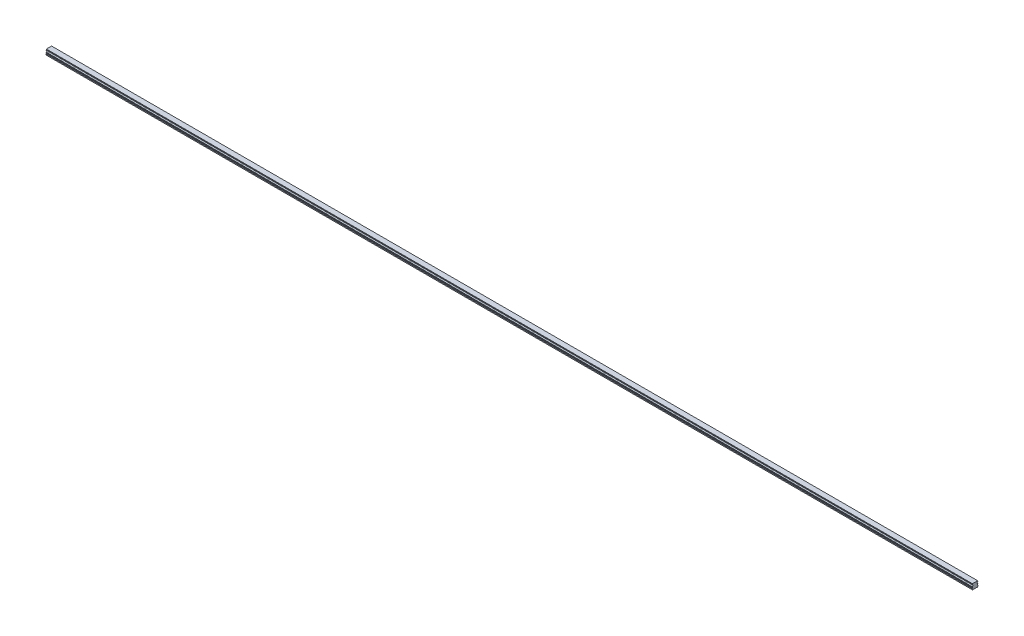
from build123d import *

# Parameters (mm, degrees)
BOSS_EXTRUDE1_DEPTH        = 2340
SKETCH3_R                  = 2.5
SKETCH3_R_2                = 2.1
CUT_EXTRUDE3_DEPTH         = 7
SKETCH3_2_R                = 2.1
CUT_EXTRUDE4_DEPTH         = 9.5
CHAMFER1_SIZE              = 0.4
LPATTERN2_COUNT            = 39
LPATTERN2_PITCH            = 60
CHAMFER1_OF_LPATTERN2_SIZE = 0.4


with BuildPart() as part:
    # Sketch1 → Boss-Extrude1 (new body)
    with BuildSketch(Plane(origin=(0, 0, 0), x_dir=(0, 0, -1), z_dir=(1, 0, 0))):
        with BuildLine():
            Line((6.59, 14), (-6.59, 14))
            Line((-6.59, 14), (-6.59, 13.15))
            Line((-6.59, 13.15), (-6.96, 12.356532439))
            Line((-6.96, 12.356532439), (-6.96, 11.435174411))
            ThreePointArc((-6.96, 11.435174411), (-5.25, 9.5), (-6.96, 7.564825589))
            Line((-6.96, 7.564825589), (-6.96, 6.643467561))
            Line((-6.96, 6.643467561), (-6.59, 5.85))
            Line((-6.59, 5.85), (-7.032116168, 4.2))
            Line((-7.032116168, 4.2), (-7.5, 3.929867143))
            Line((-7.5, 3.929867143), (-7.5, 1.4))
            Line((-7.5, 1.4), (-6.1, 0))
            Line((-6.1, 0), (-3.65, 0))
            Line((-3.65, 0), (-3.25, 0.4))
            Line((-3.25, 0.4), (3.25, 0.4))
            Line((3.25, 0.4), (3.65, 0))
            Line((3.65, 0), (6.1, 0))
            Line((6.1, 0), (7.5, 1.4))
            Line((7.5, 1.4), (7.5, 3.929867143))
            Line((7.5, 3.929867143), (7.032116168, 4.2))
            Line((7.032116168, 4.2), (6.59, 5.85))
            Line((6.59, 5.85), (6.96, 6.643467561))
            Line((6.96, 6.643467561), (6.96, 7.564825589))
            ThreePointArc((6.96, 7.564825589), (5.25, 9.5), (6.96, 11.435174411))
            Line((6.96, 11.435174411), (6.96, 12.356532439))
            Line((6.96, 12.356532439), (6.59, 13.15))
            Line((6.59, 13.15), (6.59, 14))
        make_face()
    extrude(amount=BOSS_EXTRUDE1_DEPTH)

    # Sketch3 → Cut-Extrude3 (cut)
    with BuildSketch(Plane.XZ):
        with Locations(Location((30, 0, 0), (0, 0, 270))):
            Circle(SKETCH3_R)
        with Locations(Location((30, 0, 0), (0, 0, 270))):
            Circle(SKETCH3_R_2, mode=Mode.SUBTRACT)
    cut_extrude3 = extrude(amount=-CUT_EXTRUDE3_DEPTH, mode=Mode.SUBTRACT)

    # Sketch3_2 → Cut-Extrude4 (cut)
    with BuildSketch(Plane.XZ):
        with Locations(Location((30, 0, 0), (0, 0, 270))):
            Circle(SKETCH3_2_R)
    cut_extrude4 = extrude(amount=-CUT_EXTRUDE4_DEPTH, mode=Mode.SUBTRACT)

    # Cut-Extrude5 cone 1 section (on through the dimple's axis) → Cut-Extrude5 (revolve, cut)
    with BuildSketch(Plane(origin=(30, 9.5, 0), x_dir=(0, 0, -1), z_dir=(1, 0, 0))):
        Polygon((0, 0), (2.1, 0), (0, 1.212435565), align=None)
    revolve(axis=Axis((30, 9.5, 0), (0, 1, 0)), mode=Mode.SUBTRACT)

    # Chamfer1
    chamfer1_edges = [part.edges().sort_by_distance(p)[0] for p in [
        (30, 0.4, 2.5),
    ]]
    chamfer(chamfer1_edges, length=CHAMFER1_SIZE)

    # LPattern2: Cut-Extrude3, Cut-Extrude4 ×39
    with Locations(*[(i * LPATTERN2_PITCH, 0, 0) for i in range(1, LPATTERN2_COUNT)]):
        add(cut_extrude3, mode=Mode.SUBTRACT)
        add(cut_extrude4, mode=Mode.SUBTRACT)

    # Chamfer1 of LPattern2
    chamfer1_of_lpattern2_edges = [part.edges().sort_by_distance(p)[0] for p in [
        (90, 0.4, 2.5),
        (150, 0.4, 2.5),
        (210, 0.4, 2.5),
        (270, 0.4, 2.5),
        (330, 0.4, 2.5),
        (390, 0.4, 2.5),
        (450, 0.4, 2.5),
        (510, 0.4, 2.5),
        (570, 0.4, 2.5),
        (630, 0.4, 2.5),
        (690, 0.4, 2.5),
        (750, 0.4, 2.5),
        (810, 0.4, 2.5),
        (870, 0.4, 2.5),
        (930, 0.4, 2.5),
        (990, 0.4, 2.5),
        (1050, 0.4, 2.5),
        (1110, 0.4, 2.5),
        (1170, 0.4, 2.5),
        (1230, 0.4, 2.5),
        (1290, 0.4, 2.5),
        (1350, 0.4, 2.5),
        (1410, 0.4, 2.5),
        (1470, 0.4, 2.5),
        (1530, 0.4, 2.5),
        (1590, 0.4, 2.5),
        (1650, 0.4, 2.5),
        (1710, 0.4, 2.5),
        (1770, 0.4, 2.5),
        (1830, 0.4, 2.5),
        (1890, 0.4, 2.5),
        (1950, 0.4, 2.5),
        (2010, 0.4, 2.5),
        (2070, 0.4, 2.5),
        (2130, 0.4, 2.5),
        (2190, 0.4, 2.5),
        (2250, 0.4, 2.5),
        (2310, 0.4, 2.5),
    ]]
    chamfer(chamfer1_of_lpattern2_edges, length=CHAMFER1_OF_LPATTERN2_SIZE)


solid = part.part
